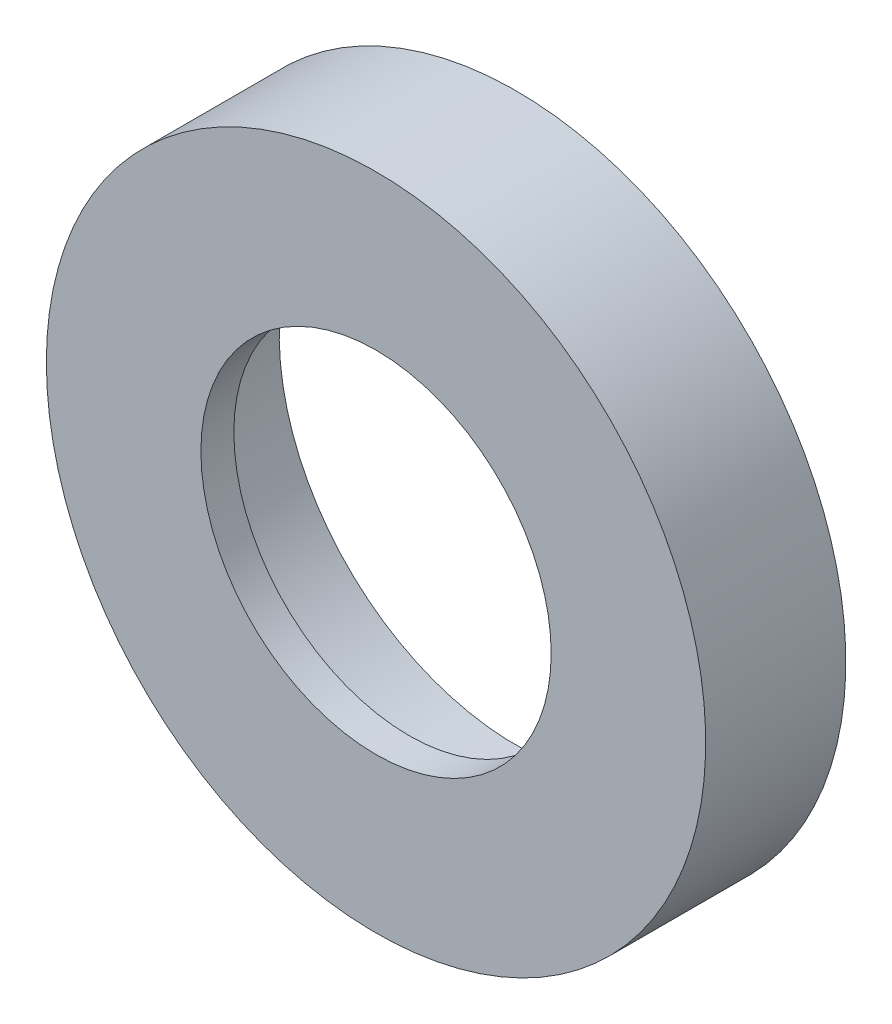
ISO-10303-21;
HEADER;
FILE_DESCRIPTION(('STEP AP214'),'2;1');
FILE_NAME('part.step','',(''),(''),'','','');
FILE_SCHEMA(('AUTOMOTIVE_DESIGN { 1 0 10303 214 1 1 1 1 }'));
ENDSEC;
DATA;
#1=APPLICATION_CONTEXT('core data for automotive mechanical design processes');
#2=APPLICATION_PROTOCOL_DEFINITION('international standard','automotive_design',2000,#1);
#3=PRODUCT_CONTEXT('',#1,'mechanical');
#4=PRODUCT('Part','Part','',(#3));
#5=PRODUCT_RELATED_PRODUCT_CATEGORY('part','',(#4));
#6=PRODUCT_DEFINITION_FORMATION('','',#4);
#7=PRODUCT_DEFINITION_CONTEXT('part definition',#1,'design');
#8=PRODUCT_DEFINITION('design','',#6,#7);
#9=PRODUCT_DEFINITION_SHAPE('','',#8);
#10=(LENGTH_UNIT() NAMED_UNIT(*) SI_UNIT(.MILLI.,.METRE.));
#11=(NAMED_UNIT(*) PLANE_ANGLE_UNIT() SI_UNIT($,.RADIAN.));
#12=(NAMED_UNIT(*) SI_UNIT($,.STERADIAN.) SOLID_ANGLE_UNIT());
#13=UNCERTAINTY_MEASURE_WITH_UNIT(LENGTH_MEASURE(1.E-05),#10,'distance_accuracy_value','');
#14=(GEOMETRIC_REPRESENTATION_CONTEXT(3) GLOBAL_UNCERTAINTY_ASSIGNED_CONTEXT((#13)) GLOBAL_UNIT_ASSIGNED_CONTEXT((#10,
#11,#12)) REPRESENTATION_CONTEXT('',''));
#15=CARTESIAN_POINT('',(0.,0.,0.));
#16=DIRECTION('',(0.,0.,1.));
#17=DIRECTION('',(1.,0.,0.));
#18=AXIS2_PLACEMENT_3D('',#15,#16,#17);
#19=CARTESIAN_POINT('',(167.999982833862,167.999982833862,0.));
#20=DIRECTION('',(0.,0.,1.));
#21=DIRECTION('',(-1.,0.,0.));
#22=AXIS2_PLACEMENT_3D('',#19,#20,#21);
#23=PLANE('',#22);
#24=CARTESIAN_POINT('',(0.,0.,0.));
#25=DIRECTION('',(0.,0.,-1.));
#26=DIRECTION('',(-1.,0.,0.));
#27=AXIS2_PLACEMENT_3D('',#24,#25,#26);
#28=CIRCLE('',#27,85.);
#29=CARTESIAN_POINT('',(-85.,0.,0.));
#30=VERTEX_POINT('',#29);
#31=EDGE_CURVE('E9',#30,#30,#28,.T.);
#32=ORIENTED_EDGE('',*,*,#31,.T.);
#33=EDGE_LOOP('',(#32));
#34=FACE_BOUND('',#33,.T.);
#35=CARTESIAN_POINT('',(0.,0.,0.));
#36=DIRECTION('',(0.,0.,-1.));
#37=DIRECTION('',(-1.,0.,0.));
#38=AXIS2_PLACEMENT_3D('',#35,#36,#37);
#39=CIRCLE('',#38,160.);
#40=CARTESIAN_POINT('',(-160.,0.,0.));
#41=VERTEX_POINT('',#40);
#42=EDGE_CURVE('E24',#41,#41,#39,.T.);
#43=ORIENTED_EDGE('',*,*,#42,.F.);
#44=EDGE_LOOP('',(#43));
#45=FACE_BOUND('',#44,.T.);
#46=ADVANCED_FACE('F14',(#34,#45),#23,.T.);
#47=CARTESIAN_POINT('',(0.,0.,0.));
#48=DIRECTION('',(0.,0.,-1.));
#49=DIRECTION('',(-1.,0.,0.));
#50=AXIS2_PLACEMENT_3D('',#47,#48,#49);
#51=CYLINDRICAL_SURFACE('',#50,160.);
#52=ORIENTED_EDGE('',*,*,#42,.T.);
#53=DIRECTION('',(0.,0.,1.));
#54=VECTOR('',#53,1.);
#55=CARTESIAN_POINT('',(-160.,0.,-34.));
#56=LINE('',#55,#54);
#57=CARTESIAN_POINT('',(-160.,0.,-68.));
#58=VERTEX_POINT('',#57);
#59=EDGE_CURVE('E58',#58,#41,#56,.T.);
#60=ORIENTED_EDGE('',*,*,#59,.F.);
#61=CARTESIAN_POINT('',(0.,0.,-68.));
#62=DIRECTION('',(0.,0.,1.));
#63=DIRECTION('',(1.,0.,0.));
#64=AXIS2_PLACEMENT_3D('',#61,#62,#63);
#65=CIRCLE('',#64,160.);
#66=EDGE_CURVE('E53',#58,#58,#65,.T.);
#67=ORIENTED_EDGE('',*,*,#66,.T.);
#68=ORIENTED_EDGE('',*,*,#59,.T.);
#69=EDGE_LOOP('',(#52,#60,#67,#68));
#70=FACE_BOUND('',#69,.T.);
#71=ADVANCED_FACE('F79',(#70),#51,.T.);
#72=CARTESIAN_POINT('',(-167.999982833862,-167.999982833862,-68.));
#73=DIRECTION('',(0.,0.,-1.));
#74=DIRECTION('',(0.,1.,0.));
#75=AXIS2_PLACEMENT_3D('',#72,#73,#74);
#76=PLANE('',#75);
#77=CARTESIAN_POINT('',(1.29193891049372E-13,2.15105711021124E-13,-68.));
#78=DIRECTION('',(0.,0.,1.));
#79=DIRECTION('',(1.,0.,0.));
#80=AXIS2_PLACEMENT_3D('',#77,#78,#79);
#81=CIRCLE('',#80,115.);
#82=CARTESIAN_POINT('',(0.,115.,-68.));
#83=VERTEX_POINT('',#82);
#84=EDGE_CURVE('E49',#83,#83,#81,.T.);
#85=ORIENTED_EDGE('',*,*,#84,.T.);
#86=EDGE_LOOP('',(#85));
#87=FACE_BOUND('',#86,.T.);
#88=ORIENTED_EDGE('',*,*,#66,.F.);
#89=EDGE_LOOP('',(#88));
#90=FACE_BOUND('',#89,.T.);
#91=ADVANCED_FACE('F54',(#87,#90),#76,.T.);
#92=CARTESIAN_POINT('',(1.29193891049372E-13,2.15105711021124E-13,-68.));
#93=DIRECTION('',(0.,0.,1.));
#94=DIRECTION('',(1.,0.,0.));
#95=AXIS2_PLACEMENT_3D('',#92,#93,#94);
#96=CYLINDRICAL_SURFACE('',#95,115.);
#97=ORIENTED_EDGE('',*,*,#84,.F.);
#98=DIRECTION('',(0.,0.,1.));
#99=VECTOR('',#98,1.);
#100=CARTESIAN_POINT('',(0.,115.,-42.));
#101=LINE('',#100,#99);
#102=CARTESIAN_POINT('',(0.,115.,-16.));
#103=VERTEX_POINT('',#102);
#104=EDGE_CURVE('E65',#83,#103,#101,.T.);
#105=ORIENTED_EDGE('',*,*,#104,.T.);
#106=CARTESIAN_POINT('',(0.,0.,-16.));
#107=DIRECTION('',(0.,0.,-1.));
#108=DIRECTION('',(-1.,0.,0.));
#109=AXIS2_PLACEMENT_3D('',#106,#107,#108);
#110=CIRCLE('',#109,115.);
#111=EDGE_CURVE('E46',#103,#103,#110,.T.);
#112=ORIENTED_EDGE('',*,*,#111,.F.);
#113=ORIENTED_EDGE('',*,*,#104,.F.);
#114=EDGE_LOOP('',(#97,#105,#112,#113));
#115=FACE_BOUND('',#114,.T.);
#116=ADVANCED_FACE('F72',(#115),#96,.F.);
#117=CARTESIAN_POINT('',(120.749995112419,-120.749995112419,-16.));
#118=DIRECTION('',(0.,0.,-1.));
#119=DIRECTION('',(-1.,0.,0.));
#120=AXIS2_PLACEMENT_3D('',#117,#118,#119);
#121=PLANE('',#120);
#122=CARTESIAN_POINT('',(0.,-1.2654880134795E-13,-16.));
#123=DIRECTION('',(0.,0.,-1.));
#124=DIRECTION('',(-1.,0.,0.));
#125=AXIS2_PLACEMENT_3D('',#122,#123,#124);
#126=CIRCLE('',#125,85.0000000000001);
#127=CARTESIAN_POINT('',(-85.,0.,-16.));
#128=VERTEX_POINT('',#127);
#129=EDGE_CURVE('E67',#128,#128,#126,.T.);
#130=ORIENTED_EDGE('',*,*,#129,.F.);
#131=EDGE_LOOP('',(#130));
#132=FACE_BOUND('',#131,.T.);
#133=ORIENTED_EDGE('',*,*,#111,.T.);
#134=EDGE_LOOP('',(#133));
#135=FACE_BOUND('',#134,.T.);
#136=ADVANCED_FACE('F69',(#132,#135),#121,.T.);
#137=CARTESIAN_POINT('',(0.,0.,0.));
#138=DIRECTION('',(0.,0.,-1.));
#139=DIRECTION('',(-1.,0.,0.));
#140=AXIS2_PLACEMENT_3D('',#137,#138,#139);
#141=CYLINDRICAL_SURFACE('',#140,85.);
#142=ORIENTED_EDGE('',*,*,#129,.T.);
#143=DIRECTION('',(0.,0.,-1.));
#144=VECTOR('',#143,1.);
#145=CARTESIAN_POINT('',(-85.,0.,-8.));
#146=LINE('',#145,#144);
#147=EDGE_CURVE('E18',#30,#128,#146,.T.);
#148=ORIENTED_EDGE('',*,*,#147,.F.);
#149=ORIENTED_EDGE('',*,*,#31,.F.);
#150=ORIENTED_EDGE('',*,*,#147,.T.);
#151=EDGE_LOOP('',(#142,#148,#149,#150));
#152=FACE_BOUND('',#151,.T.);
#153=ADVANCED_FACE('F16',(#152),#141,.F.);
#154=CLOSED_SHELL('',(#46,#71,#91,#116,#136,#153));
#155=MANIFOLD_SOLID_BREP('B1',#154);
#156=ADVANCED_BREP_SHAPE_REPRESENTATION('',(#18,#155),#14);
#157=SHAPE_DEFINITION_REPRESENTATION(#9,#156);
ENDSEC;
END-ISO-10303-21;
